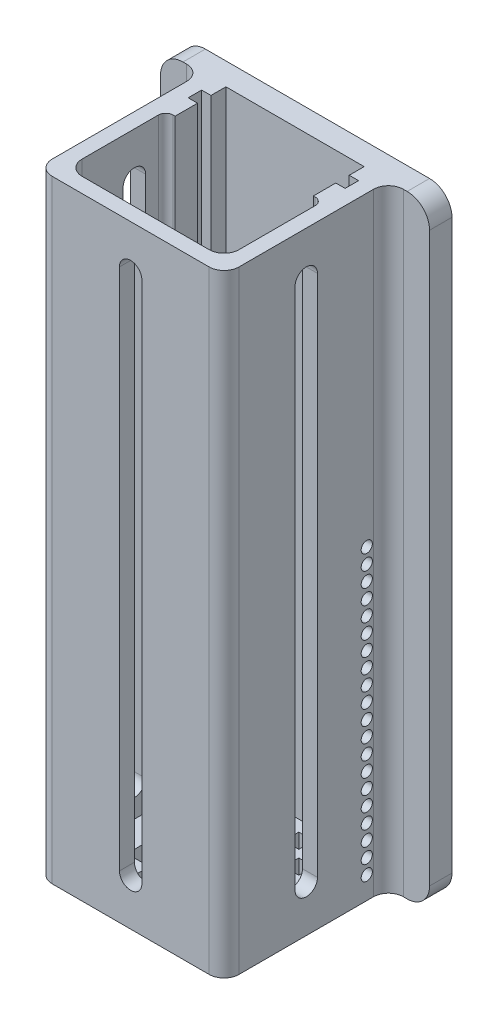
from build123d import *

# Parameters (mm, degrees)
EXTRUSION1_DEPTH        = 80
EXTRUSION2_START        = 2
ESQUISSE2_W             = 2
ESQUISSE2_H             = 2
EXTRUSION2_DEPTH        = 2
ENL_V_MAT_EXTRU_1_DEPTH = 2
ESQUISSE4_R             = 0.75
ENL_V_MAT_EXTRU_2_DEPTH = 91.720725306
ENL_V_MAT_EXTRU_3_DEPTH = 91.720725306
CONG_1_R                = 3


with BuildPart() as part:
    # Esquisse1 → Extrusion1 (new body)
    with BuildSketch(Plane(origin=(0, 0, 0), x_dir=(1, 0, 0), z_dir=(0, 1, 0))):
        with BuildLine():
            Line((2, 5), (23, 5))
            ThreePointArc((23, 5), (24.414213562, 5.585786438), (25, 7))
            Line((25, 7), (25, 25))
            ThreePointArc((25, 25), (25.585786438, 26.414213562), (27, 27))
            Line((27, 27), (30.5, 27))
            Line((30.5, 27), (30.5, 30))
            Line((30.5, 30), (-5.5, 30))
            Line((-5.5, 30), (-5.5, 27))
            Line((-5.5, 27), (-2, 27))
            ThreePointArc((-2, 27), (-0.585786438, 26.414213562), (0, 25))
            Line((0, 25), (0, 7))
            ThreePointArc((0, 7), (0.585786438, 5.585786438), (2, 5))
        make_face()
        with BuildLine():
            Line((4, 7), (21, 7))
            ThreePointArc((21, 7), (22.414213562, 7.585786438), (23, 9))
            Line((23, 9), (23, 19.2))
            ThreePointArc((23, 19.2), (22.707106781, 19.907106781), (22, 20.2))
            Line((22, 20.2), (21.75, 20.2))
            Line((21.75, 20.2), (21.75, 23.2))
            Line((21.75, 23.2), (23, 23.2))
            Line((23, 23.2), (23, 25))
            Line((23, 25), (21.75, 25))
            Line((21.75, 25), (21.75, 27))
            Line((21.75, 27), (3.25, 27))
            Line((3.25, 27), (3.25, 25))
            Line((3.25, 25), (2, 25))
            Line((2, 25), (2, 23.2))
            Line((2, 23.2), (3.25, 23.2))
            Line((3.25, 23.2), (3.25, 20.2))
            Line((3.25, 20.2), (3, 20.2))
            ThreePointArc((3, 20.2), (2.292893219, 19.907106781), (2, 19.2))
            Line((2, 19.2), (2, 9))
            ThreePointArc((2, 9), (2.585786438, 7.585786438), (4, 7))
        make_face(mode=Mode.SUBTRACT)
    extrude(amount=EXTRUSION1_DEPTH)

    # Esquisse2 → Extrusion2 (add)
    with BuildSketch(Plane.XZ.offset(EXTRUSION2_START)):
        with BuildLine():
            Line((-5.5, -27), (-5.5, -30))
            Line((-5.5, -30), (30.5, -30))
            Line((30.5, -30), (30.5, -27))
            Line((30.5, -27), (27, -27))
            ThreePointArc((27, -27), (25.585786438, -26.414213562), (25, -25))
            Line((25, -25), (25, -7))
            ThreePointArc((25, -7), (24.414213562, -5.585786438), (23, -5))
            Line((23, -5), (2, -5))
            ThreePointArc((2, -5), (0.585786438, -5.585786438), (0, -7))
            Line((0, -7), (0, -25))
            ThreePointArc((0, -25), (-0.585786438, -26.414213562), (-2, -27))
            Line((-2, -27), (-5.5, -27))
        make_face()
        with Locations((6.5, -9.5)):
            Rectangle(ESQUISSE2_W, ESQUISSE2_H, mode=Mode.SUBTRACT)
        with Locations((9.5, -9.5)):
            Rectangle(ESQUISSE2_W, ESQUISSE2_H, mode=Mode.SUBTRACT)
        with Locations((12.5, -9.5)):
            Rectangle(ESQUISSE2_W, ESQUISSE2_H, mode=Mode.SUBTRACT)
        with Locations((15.5, -9.5)):
            Rectangle(ESQUISSE2_W, ESQUISSE2_H, mode=Mode.SUBTRACT)
        with Locations((18.5, -9.5)):
            Rectangle(ESQUISSE2_W, ESQUISSE2_H, mode=Mode.SUBTRACT)
        with Locations((6.5, -12.5)):
            Rectangle(ESQUISSE2_W, ESQUISSE2_H, mode=Mode.SUBTRACT)
        with Locations((9.5, -12.5)):
            Rectangle(ESQUISSE2_W, ESQUISSE2_H, mode=Mode.SUBTRACT)
        with Locations((12.5, -12.5)):
            Rectangle(ESQUISSE2_W, ESQUISSE2_H, mode=Mode.SUBTRACT)
        with Locations((15.5, -12.5)):
            Rectangle(ESQUISSE2_W, ESQUISSE2_H, mode=Mode.SUBTRACT)
        with Locations((18.5, -12.5)):
            Rectangle(ESQUISSE2_W, ESQUISSE2_H, mode=Mode.SUBTRACT)
        with Locations((6.5, -15.5)):
            Rectangle(ESQUISSE2_W, ESQUISSE2_H, mode=Mode.SUBTRACT)
        with Locations((9.5, -15.5)):
            Rectangle(ESQUISSE2_W, ESQUISSE2_H, mode=Mode.SUBTRACT)
        with Locations((12.5, -15.5)):
            Rectangle(ESQUISSE2_W, ESQUISSE2_H, mode=Mode.SUBTRACT)
        with Locations((15.5, -15.5)):
            Rectangle(ESQUISSE2_W, ESQUISSE2_H, mode=Mode.SUBTRACT)
        with Locations((18.5, -15.5)):
            Rectangle(ESQUISSE2_W, ESQUISSE2_H, mode=Mode.SUBTRACT)
        with Locations((6.5, -18.5)):
            Rectangle(ESQUISSE2_W, ESQUISSE2_H, mode=Mode.SUBTRACT)
        with Locations((9.5, -18.5)):
            Rectangle(ESQUISSE2_W, ESQUISSE2_H, mode=Mode.SUBTRACT)
        with Locations((12.5, -18.5)):
            Rectangle(ESQUISSE2_W, ESQUISSE2_H, mode=Mode.SUBTRACT)
        with Locations((15.5, -18.5)):
            Rectangle(ESQUISSE2_W, ESQUISSE2_H, mode=Mode.SUBTRACT)
        with Locations((18.5, -18.5)):
            Rectangle(ESQUISSE2_W, ESQUISSE2_H, mode=Mode.SUBTRACT)
        with Locations((6.5, -21.5)):
            Rectangle(ESQUISSE2_W, ESQUISSE2_H, mode=Mode.SUBTRACT)
        with Locations((9.5, -21.5)):
            Rectangle(ESQUISSE2_W, ESQUISSE2_H, mode=Mode.SUBTRACT)
        with Locations((12.5, -21.5)):
            Rectangle(ESQUISSE2_W, ESQUISSE2_H, mode=Mode.SUBTRACT)
        with Locations((15.5, -21.5)):
            Rectangle(ESQUISSE2_W, ESQUISSE2_H, mode=Mode.SUBTRACT)
        with Locations((18.5, -21.5)):
            Rectangle(ESQUISSE2_W, ESQUISSE2_H, mode=Mode.SUBTRACT)
        with Locations((6.5, -24.5)):
            Rectangle(ESQUISSE2_W, ESQUISSE2_H, mode=Mode.SUBTRACT)
        with Locations((9.5, -24.5)):
            Rectangle(ESQUISSE2_W, ESQUISSE2_H, mode=Mode.SUBTRACT)
        with Locations((12.5, -24.5)):
            Rectangle(ESQUISSE2_W, ESQUISSE2_H, mode=Mode.SUBTRACT)
        with Locations((15.5, -24.5)):
            Rectangle(ESQUISSE2_W, ESQUISSE2_H, mode=Mode.SUBTRACT)
        with Locations((18.5, -24.5)):
            Rectangle(ESQUISSE2_W, ESQUISSE2_H, mode=Mode.SUBTRACT)
    extrude(amount=-EXTRUSION2_DEPTH)

    # Esquisse3 → Enl_v. mat.-Extru.1 (cut)
    with BuildSketch(Plane.XY.offset(-5)):
        with BuildLine():
            Line((14, 4), (14, 74))
            ThreePointArc((14, 74), (12.5, 75.5), (11, 74))
            Line((11, 74), (11, 4))
            ThreePointArc((11, 4), (12.5, 2.5), (14, 4))
        make_face()
    extrude(amount=-ENL_V_MAT_EXTRU_1_DEPTH, mode=Mode.SUBTRACT)

    # Esquisse4 → Enl_v. mat.-Extru.2 (cut, through all)
    with BuildSketch(Plane.ZY):
        with Locations((-24.1, 1)):
            Circle(ESQUISSE4_R)
        with Locations((-24.1, 3)):
            Circle(ESQUISSE4_R)
        with Locations((-24.1, 5)):
            Circle(ESQUISSE4_R)
        with Locations((-24.1, 7)):
            Circle(ESQUISSE4_R)
        with Locations((-24.1, 9)):
            Circle(ESQUISSE4_R)
        with Locations((-24.1, 11)):
            Circle(ESQUISSE4_R)
        with Locations((-24.1, 13)):
            Circle(ESQUISSE4_R)
        with Locations((-24.1, 15)):
            Circle(ESQUISSE4_R)
        with Locations((-24.1, 17)):
            Circle(ESQUISSE4_R)
        with Locations((-24.1, 19)):
            Circle(ESQUISSE4_R)
        with Locations((-24.1, 21)):
            Circle(ESQUISSE4_R)
        with Locations((-24.1, 23)):
            Circle(ESQUISSE4_R)
        with Locations((-24.1, 25)):
            Circle(ESQUISSE4_R)
        with Locations((-24.1, 27)):
            Circle(ESQUISSE4_R)
        with Locations((-24.1, 29)):
            Circle(ESQUISSE4_R)
        with Locations((-24.1, 31)):
            Circle(ESQUISSE4_R)
        with Locations((-24.1, 33)):
            Circle(ESQUISSE4_R)
        with Locations((-24.1, 35)):
            Circle(ESQUISSE4_R)
        with Locations((-24.1, 37)):
            Circle(ESQUISSE4_R)
        with Locations((-24.1, 39)):
            Circle(ESQUISSE4_R)
    extrude(amount=-ENL_V_MAT_EXTRU_2_DEPTH, mode=Mode.SUBTRACT)

    # Esquisse5 → Enl_v. mat.-Extru.3 (cut, through all)
    with BuildSketch(Plane.ZY):
        with BuildLine():
            Line((-17.5, 74), (-17.5, 4))
            ThreePointArc((-17.5, 4), (-16, 2.5), (-14.5, 4))
            Line((-14.5, 4), (-14.5, 74))
            ThreePointArc((-14.5, 74), (-16, 75.5), (-17.5, 74))
        make_face()
    extrude(amount=-ENL_V_MAT_EXTRU_3_DEPTH, mode=Mode.SUBTRACT)

    # Cong_1
    cong_1_edges = [part.edges().sort_by_distance(p)[0] for p in [
        (30.5, -2, -28.5),
        (30.5, 80, -28.5),
        (-5.5, 80, -28.5),
        (-5.5, -2, -28.5),
    ]]
    fillet(cong_1_edges, radius=CONG_1_R)


solid = part.part
